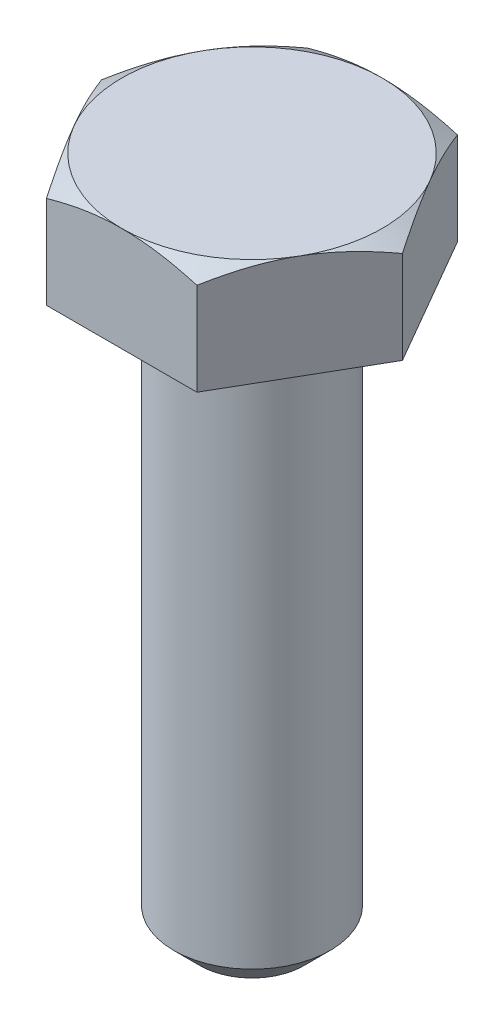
ISO-10303-21;
HEADER;
FILE_DESCRIPTION(('STEP AP214'),'2;1');
FILE_NAME('part.step','',(''),(''),'','','');
FILE_SCHEMA(('AUTOMOTIVE_DESIGN { 1 0 10303 214 1 1 1 1 }'));
ENDSEC;
DATA;
#1=APPLICATION_CONTEXT('core data for automotive mechanical design processes');
#2=APPLICATION_PROTOCOL_DEFINITION('international standard','automotive_design',2000,#1);
#3=PRODUCT_CONTEXT('',#1,'mechanical');
#4=PRODUCT('Part','Part','',(#3));
#5=PRODUCT_RELATED_PRODUCT_CATEGORY('part','',(#4));
#6=PRODUCT_DEFINITION_FORMATION('','',#4);
#7=PRODUCT_DEFINITION_CONTEXT('part definition',#1,'design');
#8=PRODUCT_DEFINITION('design','',#6,#7);
#9=PRODUCT_DEFINITION_SHAPE('','',#8);
#10=(LENGTH_UNIT() NAMED_UNIT(*) SI_UNIT(.MILLI.,.METRE.));
#11=(NAMED_UNIT(*) PLANE_ANGLE_UNIT() SI_UNIT($,.RADIAN.));
#12=(NAMED_UNIT(*) SI_UNIT($,.STERADIAN.) SOLID_ANGLE_UNIT());
#13=UNCERTAINTY_MEASURE_WITH_UNIT(LENGTH_MEASURE(1.E-05),#10,'distance_accuracy_value','');
#14=(GEOMETRIC_REPRESENTATION_CONTEXT(3) GLOBAL_UNCERTAINTY_ASSIGNED_CONTEXT((#13)) GLOBAL_UNIT_ASSIGNED_CONTEXT((#10,
#11,#12)) REPRESENTATION_CONTEXT('',''));
#15=CARTESIAN_POINT('',(0.,0.,0.));
#16=DIRECTION('',(0.,0.,1.));
#17=DIRECTION('',(1.,0.,0.));
#18=AXIS2_PLACEMENT_3D('',#15,#16,#17);
#19=CARTESIAN_POINT('',(0.,4.,0.));
#20=DIRECTION('',(0.,-1.,0.));
#21=DIRECTION('',(1.,0.,0.));
#22=AXIS2_PLACEMENT_3D('',#19,#20,#21);
#23=PLANE('',#22);
#24=CARTESIAN_POINT('',(0.,4.,0.));
#25=DIRECTION('',(0.,-1.,0.));
#26=DIRECTION('',(1.,0.,0.));
#27=AXIS2_PLACEMENT_3D('',#24,#25,#26);
#28=CIRCLE('',#27,5.);
#29=CARTESIAN_POINT('',(4.33012701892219,4.,2.50000000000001));
#30=VERTEX_POINT('',#29);
#31=CARTESIAN_POINT('',(0.,4.,4.99999999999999));
#32=VERTEX_POINT('',#31);
#33=EDGE_CURVE('E89',#30,#32,#28,.T.);
#34=ORIENTED_EDGE('',*,*,#33,.F.);
#35=CARTESIAN_POINT('',(0.,4.,0.));
#36=DIRECTION('',(0.,-1.,0.));
#37=DIRECTION('',(1.,0.,0.));
#38=AXIS2_PLACEMENT_3D('',#35,#36,#37);
#39=CIRCLE('',#38,5.);
#40=CARTESIAN_POINT('',(4.33012701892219,4.,-2.50000000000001));
#41=VERTEX_POINT('',#40);
#42=EDGE_CURVE('E87',#41,#30,#39,.T.);
#43=ORIENTED_EDGE('',*,*,#42,.F.);
#44=CARTESIAN_POINT('',(0.,4.,0.));
#45=DIRECTION('',(0.,-1.,0.));
#46=DIRECTION('',(1.,0.,0.));
#47=AXIS2_PLACEMENT_3D('',#44,#45,#46);
#48=CIRCLE('',#47,4.99999999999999);
#49=CARTESIAN_POINT('',(0.,4.,-4.99999999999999));
#50=VERTEX_POINT('',#49);
#51=EDGE_CURVE('E20',#50,#41,#48,.T.);
#52=ORIENTED_EDGE('',*,*,#51,.F.);
#53=CARTESIAN_POINT('',(0.,4.,0.));
#54=DIRECTION('',(0.,-1.,0.));
#55=DIRECTION('',(1.,0.,0.));
#56=AXIS2_PLACEMENT_3D('',#53,#54,#55);
#57=CIRCLE('',#56,5.);
#58=CARTESIAN_POINT('',(-4.33012701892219,4.,-2.50000000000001));
#59=VERTEX_POINT('',#58);
#60=EDGE_CURVE('E104',#59,#50,#57,.T.);
#61=ORIENTED_EDGE('',*,*,#60,.F.);
#62=CARTESIAN_POINT('',(0.,4.,0.));
#63=DIRECTION('',(0.,-1.,0.));
#64=DIRECTION('',(1.,0.,0.));
#65=AXIS2_PLACEMENT_3D('',#62,#63,#64);
#66=CIRCLE('',#65,5.);
#67=CARTESIAN_POINT('',(-4.33012701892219,4.,2.50000000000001));
#68=VERTEX_POINT('',#67);
#69=EDGE_CURVE('E323',#68,#59,#66,.T.);
#70=ORIENTED_EDGE('',*,*,#69,.F.);
#71=CARTESIAN_POINT('',(0.,4.,0.));
#72=DIRECTION('',(0.,-1.,0.));
#73=DIRECTION('',(1.,0.,0.));
#74=AXIS2_PLACEMENT_3D('',#71,#72,#73);
#75=CIRCLE('',#74,4.99999999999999);
#76=EDGE_CURVE('E93',#32,#68,#75,.T.);
#77=ORIENTED_EDGE('',*,*,#76,.F.);
#78=EDGE_LOOP('',(#34,#43,#52,#61,#70,#77));
#79=FACE_BOUND('',#78,.T.);
#80=ADVANCED_FACE('F16',(#79),#23,.F.);
#81=CARTESIAN_POINT('',(0.,3.55073852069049,0.));
#82=DIRECTION('',(0.,-1.,0.));
#83=DIRECTION('',(1.,0.,0.));
#84=AXIS2_PLACEMENT_3D('',#81,#82,#83);
#85=CONICAL_SURFACE('',#84,5.77814370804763,1.0471975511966);
#86=ORIENTED_EDGE('',*,*,#51,.T.);
#87=CARTESIAN_POINT('',(2.88675134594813,3.5534180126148,-4.99999999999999));
#88=CARTESIAN_POINT('',(3.00424151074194,3.62126800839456,-4.79650106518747));
#89=CARTESIAN_POINT('',(3.12267257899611,3.68343045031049,-4.59137243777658));
#90=CARTESIAN_POINT('',(3.36057867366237,3.79305279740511,-4.17930699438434));
#91=CARTESIAN_POINT('',(3.48004540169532,3.8405854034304,-3.97238455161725));
#92=CARTESIAN_POINT('',(3.66037296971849,3.89894737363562,-3.66004804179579));
#93=CARTESIAN_POINT('',(3.72070995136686,3.9162522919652,-3.55554132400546));
#94=CARTESIAN_POINT('',(3.84167277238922,3.94620746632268,-3.34602757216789));
#95=CARTESIAN_POINT('',(3.9022986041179,3.95885784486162,-3.24102055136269));
#96=CARTESIAN_POINT('',(4.02406337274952,3.97928167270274,-3.03011778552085));
#97=CARTESIAN_POINT('',(4.08520335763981,3.9870303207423,-2.92422022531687));
#98=CARTESIAN_POINT('',(4.20760356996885,3.99740020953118,-2.71221683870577));
#99=CARTESIAN_POINT('',(4.26886381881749,4.00002043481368,-2.60611097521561));
#100=CARTESIAN_POINT('',(4.33012701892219,4.,-2.50000000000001));
#101=B_SPLINE_CURVE_WITH_KNOTS('',3,(#87,#88,#89,#90,#91,#92,#93,#94,#95,#96,#97,#98,#99,#100),
.UNSPECIFIED.,.F.,.F.,(4,2,2,2,2,2,4),(0.,0.734036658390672,1.4643644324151,1.83000749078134,
2.19564092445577,2.56310985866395,2.93065154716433),.UNSPECIFIED.);
#102=CARTESIAN_POINT('',(2.88675134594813,3.5534180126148,-4.99999999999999));
#103=VERTEX_POINT('',#102);
#104=EDGE_CURVE('E99',#103,#41,#101,.T.);
#105=ORIENTED_EDGE('',*,*,#104,.F.);
#106=CARTESIAN_POINT('',(0.,4.00000000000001,-4.99999999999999));
#107=CARTESIAN_POINT('',(0.122526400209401,4.00002043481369,-4.99999999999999));
#108=CARTESIAN_POINT('',(0.245046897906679,3.99740020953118,-4.99999999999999));
#109=CARTESIAN_POINT('',(0.489847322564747,3.98703032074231,-4.99999999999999));
#110=CARTESIAN_POINT('',(0.61212729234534,3.97928167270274,-4.99999999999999));
#111=CARTESIAN_POINT('',(0.855656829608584,3.95885784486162,-4.99999999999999));
#112=CARTESIAN_POINT('',(0.976908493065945,3.94620746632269,-4.99999999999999));
#113=CARTESIAN_POINT('',(1.21883413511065,3.9162522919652,-4.99999999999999));
#114=CARTESIAN_POINT('',(1.33950809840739,3.89894737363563,-4.99999999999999));
#115=CARTESIAN_POINT('',(1.70016323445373,3.8405854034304,-4.99999999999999));
#116=CARTESIAN_POINT('',(1.93909669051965,3.79305279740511,-4.99999999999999));
#117=CARTESIAN_POINT('',(2.41490887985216,3.68343045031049,-4.99999999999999));
#118=CARTESIAN_POINT('',(2.6517710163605,3.62126800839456,-4.99999999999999));
#119=CARTESIAN_POINT('',(2.88675134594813,3.5534180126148,-4.99999999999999));
#120=B_SPLINE_CURVE_WITH_KNOTS('',3,(#106,#107,#108,#109,#110,#111,#112,#113,#114,#115,#116,
#117,#118,#119),.UNSPECIFIED.,.F.,.F.,(4,2,2,2,2,2,4),(0.,0.367541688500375,0.735010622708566,
1.10064405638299,1.46628711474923,2.19661488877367,2.93065154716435),.UNSPECIFIED.);
#121=EDGE_CURVE('E102',#50,#103,#120,.T.);
#122=ORIENTED_EDGE('',*,*,#121,.F.);
#123=EDGE_LOOP('',(#86,#105,#122));
#124=FACE_BOUND('',#123,.T.);
#125=ADVANCED_FACE('F97',(#124),#85,.T.);
#126=CARTESIAN_POINT('',(0.,3.55073852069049,0.));
#127=DIRECTION('',(0.,-1.,0.));
#128=DIRECTION('',(1.,0.,0.));
#129=AXIS2_PLACEMENT_3D('',#126,#127,#128);
#130=CONICAL_SURFACE('',#129,5.77814370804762,1.0471975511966);
#131=ORIENTED_EDGE('',*,*,#60,.T.);
#132=CARTESIAN_POINT('',(-2.88675134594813,3.5534180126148,-4.99999999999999));
#133=CARTESIAN_POINT('',(-2.65177101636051,3.62126800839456,-4.99999999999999));
#134=CARTESIAN_POINT('',(-2.41490887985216,3.68343045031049,-4.99999999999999));
#135=CARTESIAN_POINT('',(-1.93909669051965,3.79305279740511,-4.99999999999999));
#136=CARTESIAN_POINT('',(-1.70016323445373,3.8405854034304,-4.99999999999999));
#137=CARTESIAN_POINT('',(-1.33950809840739,3.89894737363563,-4.99999999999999));
#138=CARTESIAN_POINT('',(-1.21883413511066,3.9162522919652,-4.99999999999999));
#139=CARTESIAN_POINT('',(-0.976908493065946,3.94620746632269,-4.99999999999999));
#140=CARTESIAN_POINT('',(-0.855656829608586,3.95885784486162,-4.99999999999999));
#141=CARTESIAN_POINT('',(-0.612127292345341,3.97928167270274,-4.99999999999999));
#142=CARTESIAN_POINT('',(-0.489847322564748,3.98703032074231,-4.99999999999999));
#143=CARTESIAN_POINT('',(-0.245046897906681,3.99740020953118,-4.99999999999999));
#144=CARTESIAN_POINT('',(-0.122526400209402,4.00002043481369,-4.99999999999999));
#145=CARTESIAN_POINT('',(0.,4.00000000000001,-4.99999999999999));
#146=B_SPLINE_CURVE_WITH_KNOTS('',3,(#132,#133,#134,#135,#136,#137,#138,#139,#140,#141,#142,
#143,#144,#145),.UNSPECIFIED.,.F.,.F.,(4,2,2,2,2,2,4),(0.,0.734036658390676,1.46436443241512,
1.83000749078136,2.19564092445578,2.56310985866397,2.93065154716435),.UNSPECIFIED.);
#147=CARTESIAN_POINT('',(-2.88675134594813,3.5534180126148,-4.99999999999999));
#148=VERTEX_POINT('',#147);
#149=EDGE_CURVE('E113',#148,#50,#146,.T.);
#150=ORIENTED_EDGE('',*,*,#149,.F.);
#151=CARTESIAN_POINT('',(-4.33012701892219,4.,-2.50000000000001));
#152=CARTESIAN_POINT('',(-4.26886381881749,4.00002043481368,-2.60611097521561));
#153=CARTESIAN_POINT('',(-4.20760356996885,3.99740020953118,-2.71221683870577));
#154=CARTESIAN_POINT('',(-4.08520335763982,3.9870303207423,-2.92422022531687));
#155=CARTESIAN_POINT('',(-4.02406337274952,3.97928167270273,-3.03011778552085));
#156=CARTESIAN_POINT('',(-3.9022986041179,3.95885784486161,-3.24102055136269));
#157=CARTESIAN_POINT('',(-3.84167277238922,3.94620746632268,-3.34602757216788));
#158=CARTESIAN_POINT('',(-3.72070995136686,3.9162522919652,-3.55554132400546));
#159=CARTESIAN_POINT('',(-3.66037296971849,3.89894737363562,-3.66004804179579));
#160=CARTESIAN_POINT('',(-3.48004540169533,3.84058540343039,-3.97238455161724));
#161=CARTESIAN_POINT('',(-3.36057867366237,3.79305279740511,-4.17930699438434));
#162=CARTESIAN_POINT('',(-3.12267257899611,3.68343045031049,-4.59137243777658));
#163=CARTESIAN_POINT('',(-3.00424151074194,3.62126800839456,-4.79650106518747));
#164=CARTESIAN_POINT('',(-2.88675134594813,3.5534180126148,-4.99999999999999));
#165=B_SPLINE_CURVE_WITH_KNOTS('',3,(#151,#152,#153,#154,#155,#156,#157,#158,#159,#160,#161,
#162,#163,#164),.UNSPECIFIED.,.F.,.F.,(4,2,2,2,2,2,4),(0.,0.367541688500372,0.735010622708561,
1.10064405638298,1.46628711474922,2.19661488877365,2.93065154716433),.UNSPECIFIED.);
#166=EDGE_CURVE('E169',#59,#148,#165,.T.);
#167=ORIENTED_EDGE('',*,*,#166,.F.);
#168=EDGE_LOOP('',(#131,#150,#167));
#169=FACE_BOUND('',#168,.T.);
#170=ADVANCED_FACE('F137',(#169),#130,.T.);
#171=CARTESIAN_POINT('',(0.,3.55073852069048,0.));
#172=DIRECTION('',(0.,-1.,0.));
#173=DIRECTION('',(1.,0.,0.));
#174=AXIS2_PLACEMENT_3D('',#171,#172,#173);
#175=CONICAL_SURFACE('',#174,5.77814370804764,1.0471975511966);
#176=ORIENTED_EDGE('',*,*,#69,.T.);
#177=CARTESIAN_POINT('',(-5.77350269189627,3.55341801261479,0.));
#178=CARTESIAN_POINT('',(-5.65601252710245,3.62126800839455,-0.203498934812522));
#179=CARTESIAN_POINT('',(-5.53758145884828,3.68343045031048,-0.40862756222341));
#180=CARTESIAN_POINT('',(-5.29967536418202,3.7930527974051,-0.820693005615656));
#181=CARTESIAN_POINT('',(-5.18020863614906,3.84058540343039,-1.02761544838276));
#182=CARTESIAN_POINT('',(-4.99988106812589,3.89894737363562,-1.33995195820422));
#183=CARTESIAN_POINT('',(-4.93954408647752,3.91625229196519,-1.44445867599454));
#184=CARTESIAN_POINT('',(-4.81858126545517,3.94620746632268,-1.65397242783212));
#185=CARTESIAN_POINT('',(-4.75795543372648,3.95885784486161,-1.75897944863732));
#186=CARTESIAN_POINT('',(-4.63619066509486,3.97928167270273,-1.96988221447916));
#187=CARTESIAN_POINT('',(-4.57505068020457,3.9870303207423,-2.07577977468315));
#188=CARTESIAN_POINT('',(-4.45265046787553,3.99740020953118,-2.28778316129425));
#189=CARTESIAN_POINT('',(-4.39139021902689,4.00002043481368,-2.39388902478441));
#190=CARTESIAN_POINT('',(-4.33012701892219,4.,-2.50000000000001));
#191=B_SPLINE_CURVE_WITH_KNOTS('',3,(#177,#178,#179,#180,#181,#182,#183,#184,#185,#186,#187,
#188,#189,#190),.UNSPECIFIED.,.F.,.F.,(4,2,2,2,2,2,4),(0.,0.73403665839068,1.46436443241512,
1.83000749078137,2.19564092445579,2.56310985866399,2.93065154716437),.UNSPECIFIED.);
#192=CARTESIAN_POINT('',(-5.77350269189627,3.55341801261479,0.));
#193=VERTEX_POINT('',#192);
#194=EDGE_CURVE('E146',#193,#59,#191,.T.);
#195=ORIENTED_EDGE('',*,*,#194,.F.);
#196=CARTESIAN_POINT('',(-4.33012701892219,4.,2.50000000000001));
#197=CARTESIAN_POINT('',(-4.39139021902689,4.00002043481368,2.39388902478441));
#198=CARTESIAN_POINT('',(-4.45265046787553,3.99740020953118,2.28778316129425));
#199=CARTESIAN_POINT('',(-4.57505068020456,3.9870303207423,2.07577977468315));
#200=CARTESIAN_POINT('',(-4.63619066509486,3.97928167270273,1.96988221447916));
#201=CARTESIAN_POINT('',(-4.75795543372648,3.95885784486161,1.75897944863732));
#202=CARTESIAN_POINT('',(-4.81858126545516,3.94620746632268,1.65397242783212));
#203=CARTESIAN_POINT('',(-4.93954408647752,3.9162522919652,1.44445867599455));
#204=CARTESIAN_POINT('',(-4.99988106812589,3.89894737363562,1.33995195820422));
#205=CARTESIAN_POINT('',(-5.18020863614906,3.84058540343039,1.02761544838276));
#206=CARTESIAN_POINT('',(-5.29967536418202,3.7930527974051,0.820693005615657));
#207=CARTESIAN_POINT('',(-5.53758145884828,3.68343045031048,0.408627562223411));
#208=CARTESIAN_POINT('',(-5.65601252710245,3.62126800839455,0.203498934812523));
#209=CARTESIAN_POINT('',(-5.77350269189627,3.55341801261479,0.));
#210=B_SPLINE_CURVE_WITH_KNOTS('',3,(#196,#197,#198,#199,#200,#201,#202,#203,#204,#205,#206,
#207,#208,#209),.UNSPECIFIED.,.F.,.F.,(4,2,2,2,2,2,4),(0.,0.367541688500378,0.735010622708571,
1.100644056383,1.46628711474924,2.19661488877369,2.93065154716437),.UNSPECIFIED.);
#211=EDGE_CURVE('E183',#68,#193,#210,.T.);
#212=ORIENTED_EDGE('',*,*,#211,.F.);
#213=EDGE_LOOP('',(#176,#195,#212));
#214=FACE_BOUND('',#213,.T.);
#215=ADVANCED_FACE('F191',(#214),#175,.T.);
#216=CARTESIAN_POINT('',(0.,3.55073852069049,0.));
#217=DIRECTION('',(0.,-1.,0.));
#218=DIRECTION('',(1.,0.,0.));
#219=AXIS2_PLACEMENT_3D('',#216,#217,#218);
#220=CONICAL_SURFACE('',#219,5.77814370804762,1.0471975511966);
#221=ORIENTED_EDGE('',*,*,#76,.T.);
#222=CARTESIAN_POINT('',(-2.88675134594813,3.5534180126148,4.99999999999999));
#223=CARTESIAN_POINT('',(-3.00424151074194,3.62126800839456,4.79650106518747));
#224=CARTESIAN_POINT('',(-3.12267257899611,3.68343045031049,4.59137243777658));
#225=CARTESIAN_POINT('',(-3.36057867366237,3.7930527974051,4.17930699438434));
#226=CARTESIAN_POINT('',(-3.48004540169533,3.84058540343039,3.97238455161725));
#227=CARTESIAN_POINT('',(-3.66037296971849,3.89894737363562,3.66004804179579));
#228=CARTESIAN_POINT('',(-3.72070995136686,3.9162522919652,3.55554132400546));
#229=CARTESIAN_POINT('',(-3.84167277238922,3.94620746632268,3.34602757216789));
#230=CARTESIAN_POINT('',(-3.9022986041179,3.95885784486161,3.24102055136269));
#231=CARTESIAN_POINT('',(-4.02406337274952,3.97928167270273,3.03011778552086));
#232=CARTESIAN_POINT('',(-4.08520335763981,3.9870303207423,2.92422022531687));
#233=CARTESIAN_POINT('',(-4.20760356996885,3.99740020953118,2.71221683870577));
#234=CARTESIAN_POINT('',(-4.26886381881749,4.00002043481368,2.60611097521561));
#235=CARTESIAN_POINT('',(-4.33012701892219,4.,2.50000000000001));
#236=B_SPLINE_CURVE_WITH_KNOTS('',3,(#222,#223,#224,#225,#226,#227,#228,#229,#230,#231,#232,
#233,#234,#235),.UNSPECIFIED.,.F.,.F.,(4,2,2,2,2,2,4),(0.,0.734036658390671,1.4643644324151,
1.83000749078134,2.19564092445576,2.56310985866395,2.93065154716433),.UNSPECIFIED.);
#237=CARTESIAN_POINT('',(-2.88675134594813,3.5534180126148,4.99999999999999));
#238=VERTEX_POINT('',#237);
#239=EDGE_CURVE('E176',#238,#68,#236,.T.);
#240=ORIENTED_EDGE('',*,*,#239,.F.);
#241=CARTESIAN_POINT('',(0.,4.00000000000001,4.99999999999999));
#242=CARTESIAN_POINT('',(-0.122526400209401,4.00002043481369,4.99999999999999));
#243=CARTESIAN_POINT('',(-0.24504689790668,3.99740020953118,4.99999999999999));
#244=CARTESIAN_POINT('',(-0.489847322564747,3.98703032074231,4.99999999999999));
#245=CARTESIAN_POINT('',(-0.61212729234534,3.97928167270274,4.99999999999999));
#246=CARTESIAN_POINT('',(-0.855656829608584,3.95885784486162,4.99999999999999));
#247=CARTESIAN_POINT('',(-0.976908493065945,3.94620746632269,4.99999999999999));
#248=CARTESIAN_POINT('',(-1.21883413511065,3.9162522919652,4.99999999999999));
#249=CARTESIAN_POINT('',(-1.33950809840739,3.89894737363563,4.99999999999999));
#250=CARTESIAN_POINT('',(-1.70016323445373,3.8405854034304,4.99999999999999));
#251=CARTESIAN_POINT('',(-1.93909669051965,3.79305279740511,4.99999999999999));
#252=CARTESIAN_POINT('',(-2.41490887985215,3.68343045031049,4.99999999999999));
#253=CARTESIAN_POINT('',(-2.6517710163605,3.62126800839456,4.99999999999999));
#254=CARTESIAN_POINT('',(-2.88675134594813,3.5534180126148,4.99999999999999));
#255=B_SPLINE_CURVE_WITH_KNOTS('',3,(#241,#242,#243,#244,#245,#246,#247,#248,#249,#250,#251,
#252,#253,#254),.UNSPECIFIED.,.F.,.F.,(4,2,2,2,2,2,4),(0.,0.367541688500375,0.735010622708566,
1.10064405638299,1.46628711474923,2.19661488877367,2.93065154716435),.UNSPECIFIED.);
#256=EDGE_CURVE('E198',#32,#238,#255,.T.);
#257=ORIENTED_EDGE('',*,*,#256,.F.);
#258=EDGE_LOOP('',(#221,#240,#257));
#259=FACE_BOUND('',#258,.T.);
#260=ADVANCED_FACE('F188',(#259),#220,.T.);
#261=CARTESIAN_POINT('',(0.,3.55073852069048,0.));
#262=DIRECTION('',(0.,-1.,0.));
#263=DIRECTION('',(1.,0.,0.));
#264=AXIS2_PLACEMENT_3D('',#261,#262,#263);
#265=CONICAL_SURFACE('',#264,5.77814370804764,1.0471975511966);
#266=ORIENTED_EDGE('',*,*,#42,.T.);
#267=CARTESIAN_POINT('',(5.77350269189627,3.55341801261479,0.));
#268=CARTESIAN_POINT('',(5.65601252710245,3.62126800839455,0.203498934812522));
#269=CARTESIAN_POINT('',(5.53758145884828,3.68343045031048,0.40862756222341));
#270=CARTESIAN_POINT('',(5.29967536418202,3.7930527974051,0.820693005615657));
#271=CARTESIAN_POINT('',(5.18020863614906,3.84058540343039,1.02761544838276));
#272=CARTESIAN_POINT('',(4.99988106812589,3.89894737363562,1.33995195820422));
#273=CARTESIAN_POINT('',(4.93954408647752,3.9162522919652,1.44445867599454));
#274=CARTESIAN_POINT('',(4.81858126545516,3.94620746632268,1.65397242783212));
#275=CARTESIAN_POINT('',(4.75795543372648,3.95885784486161,1.75897944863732));
#276=CARTESIAN_POINT('',(4.63619066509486,3.97928167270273,1.96988221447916));
#277=CARTESIAN_POINT('',(4.57505068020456,3.9870303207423,2.07577977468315));
#278=CARTESIAN_POINT('',(4.45265046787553,3.99740020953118,2.28778316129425));
#279=CARTESIAN_POINT('',(4.39139021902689,4.00002043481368,2.39388902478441));
#280=CARTESIAN_POINT('',(4.33012701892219,4.,2.50000000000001));
#281=B_SPLINE_CURVE_WITH_KNOTS('',3,(#267,#268,#269,#270,#271,#272,#273,#274,#275,#276,#277,
#278,#279,#280),.UNSPECIFIED.,.F.,.F.,(4,2,2,2,2,2,4),(0.,0.734036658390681,1.46436443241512,
1.83000749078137,2.19564092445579,2.56310985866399,2.93065154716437),.UNSPECIFIED.);
#282=CARTESIAN_POINT('',(5.77350269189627,3.55341801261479,0.));
#283=VERTEX_POINT('',#282);
#284=EDGE_CURVE('E109',#283,#30,#281,.T.);
#285=ORIENTED_EDGE('',*,*,#284,.F.);
#286=CARTESIAN_POINT('',(4.33012701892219,4.,-2.50000000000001));
#287=CARTESIAN_POINT('',(4.39139021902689,4.00002043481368,-2.39388902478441));
#288=CARTESIAN_POINT('',(4.45265046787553,3.99740020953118,-2.28778316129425));
#289=CARTESIAN_POINT('',(4.57505068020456,3.9870303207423,-2.07577977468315));
#290=CARTESIAN_POINT('',(4.63619066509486,3.97928167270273,-1.96988221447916));
#291=CARTESIAN_POINT('',(4.75795543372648,3.95885784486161,-1.75897944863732));
#292=CARTESIAN_POINT('',(4.81858126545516,3.94620746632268,-1.65397242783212));
#293=CARTESIAN_POINT('',(4.93954408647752,3.9162522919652,-1.44445867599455));
#294=CARTESIAN_POINT('',(4.99988106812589,3.89894737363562,-1.33995195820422));
#295=CARTESIAN_POINT('',(5.18020863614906,3.84058540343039,-1.02761544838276));
#296=CARTESIAN_POINT('',(5.29967536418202,3.7930527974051,-0.820693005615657));
#297=CARTESIAN_POINT('',(5.53758145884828,3.68343045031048,-0.408627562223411));
#298=CARTESIAN_POINT('',(5.65601252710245,3.62126800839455,-0.203498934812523));
#299=CARTESIAN_POINT('',(5.77350269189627,3.55341801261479,0.));
#300=B_SPLINE_CURVE_WITH_KNOTS('',3,(#286,#287,#288,#289,#290,#291,#292,#293,#294,#295,#296,
#297,#298,#299),.UNSPECIFIED.,.F.,.F.,(4,2,2,2,2,2,4),(0.,0.367541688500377,0.735010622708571,
1.100644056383,1.46628711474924,2.19661488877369,2.93065154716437),.UNSPECIFIED.);
#301=EDGE_CURVE('E106',#41,#283,#300,.T.);
#302=ORIENTED_EDGE('',*,*,#301,.F.);
#303=EDGE_LOOP('',(#266,#285,#302));
#304=FACE_BOUND('',#303,.T.);
#305=ADVANCED_FACE('F107',(#304),#265,.T.);
#306=CARTESIAN_POINT('',(0.,3.55073852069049,0.));
#307=DIRECTION('',(0.,-1.,0.));
#308=DIRECTION('',(1.,0.,0.));
#309=AXIS2_PLACEMENT_3D('',#306,#307,#308);
#310=CONICAL_SURFACE('',#309,5.77814370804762,1.0471975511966);
#311=ORIENTED_EDGE('',*,*,#33,.T.);
#312=CARTESIAN_POINT('',(2.88675134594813,3.5534180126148,4.99999999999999));
#313=CARTESIAN_POINT('',(2.6517710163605,3.62126800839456,4.99999999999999));
#314=CARTESIAN_POINT('',(2.41490887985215,3.68343045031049,4.99999999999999));
#315=CARTESIAN_POINT('',(1.93909669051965,3.79305279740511,4.99999999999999));
#316=CARTESIAN_POINT('',(1.70016323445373,3.8405854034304,4.99999999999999));
#317=CARTESIAN_POINT('',(1.33950809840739,3.89894737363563,4.99999999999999));
#318=CARTESIAN_POINT('',(1.21883413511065,3.9162522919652,4.99999999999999));
#319=CARTESIAN_POINT('',(0.976908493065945,3.94620746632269,4.99999999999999));
#320=CARTESIAN_POINT('',(0.855656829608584,3.95885784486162,4.99999999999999));
#321=CARTESIAN_POINT('',(0.61212729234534,3.97928167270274,4.99999999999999));
#322=CARTESIAN_POINT('',(0.489847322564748,3.98703032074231,4.99999999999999));
#323=CARTESIAN_POINT('',(0.24504689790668,3.99740020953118,4.99999999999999));
#324=CARTESIAN_POINT('',(0.122526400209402,4.00002043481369,4.99999999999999));
#325=CARTESIAN_POINT('',(0.,4.00000000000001,4.99999999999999));
#326=B_SPLINE_CURVE_WITH_KNOTS('',3,(#312,#313,#314,#315,#316,#317,#318,#319,#320,#321,#322,
#323,#324,#325),.UNSPECIFIED.,.F.,.F.,(4,2,2,2,2,2,4),(0.,0.734036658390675,1.46436443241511,
1.83000749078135,2.19564092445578,2.56310985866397,2.93065154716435),.UNSPECIFIED.);
#327=CARTESIAN_POINT('',(2.88675134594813,3.5534180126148,4.99999999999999));
#328=VERTEX_POINT('',#327);
#329=EDGE_CURVE('E205',#328,#32,#326,.T.);
#330=ORIENTED_EDGE('',*,*,#329,.F.);
#331=CARTESIAN_POINT('',(4.33012701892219,4.,2.50000000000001));
#332=CARTESIAN_POINT('',(4.26886381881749,4.00002043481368,2.60611097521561));
#333=CARTESIAN_POINT('',(4.20760356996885,3.99740020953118,2.71221683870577));
#334=CARTESIAN_POINT('',(4.08520335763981,3.9870303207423,2.92422022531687));
#335=CARTESIAN_POINT('',(4.02406337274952,3.97928167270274,3.03011778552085));
#336=CARTESIAN_POINT('',(3.90229860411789,3.95885784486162,3.24102055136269));
#337=CARTESIAN_POINT('',(3.84167277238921,3.94620746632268,3.34602757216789));
#338=CARTESIAN_POINT('',(3.72070995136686,3.9162522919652,3.55554132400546));
#339=CARTESIAN_POINT('',(3.66037296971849,3.89894737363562,3.66004804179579));
#340=CARTESIAN_POINT('',(3.48004540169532,3.8405854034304,3.97238455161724));
#341=CARTESIAN_POINT('',(3.36057867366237,3.79305279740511,4.17930699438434));
#342=CARTESIAN_POINT('',(3.12267257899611,3.68343045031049,4.59137243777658));
#343=CARTESIAN_POINT('',(3.00424151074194,3.62126800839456,4.79650106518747));
#344=CARTESIAN_POINT('',(2.88675134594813,3.5534180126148,4.99999999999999));
#345=B_SPLINE_CURVE_WITH_KNOTS('',3,(#331,#332,#333,#334,#335,#336,#337,#338,#339,#340,#341,
#342,#343,#344),.UNSPECIFIED.,.F.,.F.,(4,2,2,2,2,2,4),(0.,0.367541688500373,0.735010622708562,
1.10064405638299,1.46628711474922,2.19661488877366,2.93065154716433),.UNSPECIFIED.);
#346=EDGE_CURVE('E225',#30,#328,#345,.T.);
#347=ORIENTED_EDGE('',*,*,#346,.F.);
#348=EDGE_LOOP('',(#311,#330,#347));
#349=FACE_BOUND('',#348,.T.);
#350=ADVANCED_FACE('F233',(#349),#310,.T.);
#351=CARTESIAN_POINT('',(0.,-22.,0.));
#352=DIRECTION('',(0.,1.,0.));
#353=DIRECTION('',(0.,0.,1.));
#354=AXIS2_PLACEMENT_3D('',#351,#352,#353);
#355=PLANE('',#354);
#356=CARTESIAN_POINT('',(0.,-21.9999999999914,0.));
#357=DIRECTION('',(0.,1.,0.));
#358=DIRECTION('',(0.,0.,1.));
#359=AXIS2_PLACEMENT_3D('',#356,#357,#358);
#360=CIRCLE('',#359,1.99999999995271);
#361=CARTESIAN_POINT('',(0.,-21.9999999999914,1.99999999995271));
#362=VERTEX_POINT('',#361);
#363=EDGE_CURVE('E232',#362,#362,#360,.T.);
#364=ORIENTED_EDGE('',*,*,#363,.F.);
#365=EDGE_LOOP('',(#364));
#366=FACE_BOUND('',#365,.T.);
#367=ADVANCED_FACE('F236',(#366),#355,.F.);
#368=CARTESIAN_POINT('',(2.88675134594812,24.2,-4.99999999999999));
#369=DIRECTION('',(0.866025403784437,0.,-0.500000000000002));
#370=DIRECTION('',(-0.500000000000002,0.,-0.866025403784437));
#371=AXIS2_PLACEMENT_3D('',#368,#369,#370);
#372=PLANE('',#371);
#373=DIRECTION('',(-0.500000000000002,0.,-0.866025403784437));
#374=VECTOR('',#373,1.);
#375=CARTESIAN_POINT('',(5.77350269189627,0.,0.));
#376=LINE('',#375,#374);
#377=CARTESIAN_POINT('',(5.77350269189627,0.,0.));
#378=VERTEX_POINT('',#377);
#379=CARTESIAN_POINT('',(2.88675134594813,0.,-4.99999999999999));
#380=VERTEX_POINT('',#379);
#381=EDGE_CURVE('E268',#378,#380,#376,.T.);
#382=ORIENTED_EDGE('',*,*,#381,.T.);
#383=DIRECTION('',(0.,1.,0.));
#384=VECTOR('',#383,1.);
#385=CARTESIAN_POINT('',(2.88675134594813,24.2,-4.99999999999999));
#386=LINE('',#385,#384);
#387=EDGE_CURVE('E117',#103,#380,#386,.F.);
#388=ORIENTED_EDGE('',*,*,#387,.F.);
#389=ORIENTED_EDGE('',*,*,#104,.T.);
#390=ORIENTED_EDGE('',*,*,#301,.T.);
#391=DIRECTION('',(0.,1.,0.));
#392=VECTOR('',#391,1.);
#393=CARTESIAN_POINT('',(5.77350269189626,24.2,0.));
#394=LINE('',#393,#392);
#395=EDGE_CURVE('E312',#378,#283,#394,.T.);
#396=ORIENTED_EDGE('',*,*,#395,.F.);
#397=EDGE_LOOP('',(#382,#388,#389,#390,#396));
#398=FACE_BOUND('',#397,.T.);
#399=ADVANCED_FACE('F115',(#398),#372,.T.);
#400=CARTESIAN_POINT('',(-2.88675134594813,24.2,-4.99999999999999));
#401=DIRECTION('',(0.,0.,-1.));
#402=DIRECTION('',(-1.,0.,0.));
#403=AXIS2_PLACEMENT_3D('',#400,#401,#402);
#404=PLANE('',#403);
#405=DIRECTION('',(-1.,0.,0.));
#406=VECTOR('',#405,1.);
#407=CARTESIAN_POINT('',(0.,0.,-4.99999999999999));
#408=LINE('',#407,#406);
#409=CARTESIAN_POINT('',(-2.88675134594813,0.,-4.99999999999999));
#410=VERTEX_POINT('',#409);
#411=EDGE_CURVE('E270',#380,#410,#408,.T.);
#412=ORIENTED_EDGE('',*,*,#411,.T.);
#413=DIRECTION('',(0.,1.,0.));
#414=VECTOR('',#413,1.);
#415=CARTESIAN_POINT('',(-2.88675134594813,24.2,-4.99999999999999));
#416=LINE('',#415,#414);
#417=EDGE_CURVE('E175',#148,#410,#416,.F.);
#418=ORIENTED_EDGE('',*,*,#417,.F.);
#419=ORIENTED_EDGE('',*,*,#149,.T.);
#420=ORIENTED_EDGE('',*,*,#121,.T.);
#421=ORIENTED_EDGE('',*,*,#387,.T.);
#422=EDGE_LOOP('',(#412,#418,#419,#420,#421));
#423=FACE_BOUND('',#422,.T.);
#424=ADVANCED_FACE('F155',(#423),#404,.T.);
#425=CARTESIAN_POINT('',(-2.88675134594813,24.2,-4.99999999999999));
#426=DIRECTION('',(-0.866025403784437,0.,-0.500000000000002));
#427=DIRECTION('',(-0.500000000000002,0.,0.866025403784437));
#428=AXIS2_PLACEMENT_3D('',#425,#426,#427);
#429=PLANE('',#428);
#430=DIRECTION('',(-0.500000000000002,0.,0.866025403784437));
#431=VECTOR('',#430,1.);
#432=CARTESIAN_POINT('',(-2.88675134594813,0.,-4.99999999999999));
#433=LINE('',#432,#431);
#434=CARTESIAN_POINT('',(-5.77350269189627,0.,0.));
#435=VERTEX_POINT('',#434);
#436=EDGE_CURVE('E278',#410,#435,#433,.T.);
#437=ORIENTED_EDGE('',*,*,#436,.T.);
#438=DIRECTION('',(0.,1.,0.));
#439=VECTOR('',#438,1.);
#440=CARTESIAN_POINT('',(-5.77350269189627,24.2,0.));
#441=LINE('',#440,#439);
#442=EDGE_CURVE('E302',#193,#435,#441,.F.);
#443=ORIENTED_EDGE('',*,*,#442,.F.);
#444=ORIENTED_EDGE('',*,*,#194,.T.);
#445=ORIENTED_EDGE('',*,*,#166,.T.);
#446=ORIENTED_EDGE('',*,*,#417,.T.);
#447=EDGE_LOOP('',(#437,#443,#444,#445,#446));
#448=FACE_BOUND('',#447,.T.);
#449=ADVANCED_FACE('F158',(#448),#429,.T.);
#450=CARTESIAN_POINT('',(-2.88675134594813,24.2,4.99999999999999));
#451=DIRECTION('',(-0.866025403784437,0.,0.500000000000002));
#452=DIRECTION('',(0.500000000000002,0.,0.866025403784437));
#453=AXIS2_PLACEMENT_3D('',#450,#451,#452);
#454=PLANE('',#453);
#455=DIRECTION('',(0.500000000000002,0.,0.866025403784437));
#456=VECTOR('',#455,1.);
#457=CARTESIAN_POINT('',(-5.77350269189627,0.,0.));
#458=LINE('',#457,#456);
#459=CARTESIAN_POINT('',(-2.88675134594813,0.,4.99999999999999));
#460=VERTEX_POINT('',#459);
#461=EDGE_CURVE('E274',#435,#460,#458,.T.);
#462=ORIENTED_EDGE('',*,*,#461,.T.);
#463=DIRECTION('',(0.,1.,0.));
#464=VECTOR('',#463,1.);
#465=CARTESIAN_POINT('',(-2.88675134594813,24.2,4.99999999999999));
#466=LINE('',#465,#464);
#467=EDGE_CURVE('E204',#238,#460,#466,.F.);
#468=ORIENTED_EDGE('',*,*,#467,.F.);
#469=ORIENTED_EDGE('',*,*,#239,.T.);
#470=ORIENTED_EDGE('',*,*,#211,.T.);
#471=ORIENTED_EDGE('',*,*,#442,.T.);
#472=EDGE_LOOP('',(#462,#468,#469,#470,#471));
#473=FACE_BOUND('',#472,.T.);
#474=ADVANCED_FACE('F164',(#473),#454,.T.);
#475=CARTESIAN_POINT('',(-2.88675134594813,24.2,4.99999999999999));
#476=DIRECTION('',(0.,0.,1.));
#477=DIRECTION('',(1.,0.,0.));
#478=AXIS2_PLACEMENT_3D('',#475,#476,#477);
#479=PLANE('',#478);
#480=DIRECTION('',(-1.,0.,0.));
#481=VECTOR('',#480,1.);
#482=CARTESIAN_POINT('',(0.,0.,4.99999999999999));
#483=LINE('',#482,#481);
#484=CARTESIAN_POINT('',(2.88675134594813,0.,4.99999999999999));
#485=VERTEX_POINT('',#484);
#486=EDGE_CURVE('E35',#460,#485,#483,.F.);
#487=ORIENTED_EDGE('',*,*,#486,.T.);
#488=DIRECTION('',(0.,1.,0.));
#489=VECTOR('',#488,1.);
#490=CARTESIAN_POINT('',(2.88675134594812,24.2,4.99999999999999));
#491=LINE('',#490,#489);
#492=EDGE_CURVE('E231',#328,#485,#491,.F.);
#493=ORIENTED_EDGE('',*,*,#492,.F.);
#494=ORIENTED_EDGE('',*,*,#329,.T.);
#495=ORIENTED_EDGE('',*,*,#256,.T.);
#496=ORIENTED_EDGE('',*,*,#467,.T.);
#497=EDGE_LOOP('',(#487,#493,#494,#495,#496));
#498=FACE_BOUND('',#497,.T.);
#499=ADVANCED_FACE('F214',(#498),#479,.T.);
#500=CARTESIAN_POINT('',(2.88675134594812,24.2,4.99999999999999));
#501=DIRECTION('',(0.866025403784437,0.,0.500000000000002));
#502=DIRECTION('',(0.500000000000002,0.,-0.866025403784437));
#503=AXIS2_PLACEMENT_3D('',#500,#501,#502);
#504=PLANE('',#503);
#505=DIRECTION('',(0.500000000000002,0.,-0.866025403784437));
#506=VECTOR('',#505,1.);
#507=CARTESIAN_POINT('',(2.88675134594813,0.,4.99999999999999));
#508=LINE('',#507,#506);
#509=EDGE_CURVE('E258',#485,#378,#508,.T.);
#510=ORIENTED_EDGE('',*,*,#509,.T.);
#511=ORIENTED_EDGE('',*,*,#395,.T.);
#512=ORIENTED_EDGE('',*,*,#284,.T.);
#513=ORIENTED_EDGE('',*,*,#346,.T.);
#514=ORIENTED_EDGE('',*,*,#492,.T.);
#515=EDGE_LOOP('',(#510,#511,#512,#513,#514));
#516=FACE_BOUND('',#515,.T.);
#517=ADVANCED_FACE('F217',(#516),#504,.T.);
#518=CARTESIAN_POINT('',(0.,-21.000000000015,0.));
#519=DIRECTION('',(0.,1.,0.));
#520=DIRECTION('',(0.,0.,1.));
#521=AXIS2_PLACEMENT_3D('',#518,#519,#520);
#522=CONICAL_SURFACE('',#521,2.99999999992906,0.785398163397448);
#523=CARTESIAN_POINT('',(0.,-21.,0.));
#524=DIRECTION('',(0.,1.,0.));
#525=DIRECTION('',(0.,0.,1.));
#526=AXIS2_PLACEMENT_3D('',#523,#524,#525);
#527=CIRCLE('',#526,3.);
#528=CARTESIAN_POINT('',(0.,-21.,3.));
#529=VERTEX_POINT('',#528);
#530=EDGE_CURVE('E26',#529,#529,#527,.T.);
#531=ORIENTED_EDGE('',*,*,#530,.F.);
#532=EDGE_LOOP('',(#531));
#533=FACE_BOUND('',#532,.T.);
#534=ORIENTED_EDGE('',*,*,#363,.T.);
#535=EDGE_LOOP('',(#534));
#536=FACE_BOUND('',#535,.T.);
#537=ADVANCED_FACE('F222',(#533,#536),#522,.T.);
#538=CARTESIAN_POINT('',(0.,0.,0.));
#539=DIRECTION('',(0.,1.,0.));
#540=DIRECTION('',(-1.,0.,0.));
#541=AXIS2_PLACEMENT_3D('',#538,#539,#540);
#542=PLANE('',#541);
#543=ORIENTED_EDGE('',*,*,#486,.F.);
#544=ORIENTED_EDGE('',*,*,#461,.F.);
#545=ORIENTED_EDGE('',*,*,#436,.F.);
#546=ORIENTED_EDGE('',*,*,#411,.F.);
#547=ORIENTED_EDGE('',*,*,#381,.F.);
#548=ORIENTED_EDGE('',*,*,#509,.F.);
#549=EDGE_LOOP('',(#543,#544,#545,#546,#547,#548));
#550=FACE_BOUND('',#549,.T.);
#551=CARTESIAN_POINT('',(0.,0.,0.));
#552=DIRECTION('',(0.,1.,0.));
#553=DIRECTION('',(0.,0.,1.));
#554=AXIS2_PLACEMENT_3D('',#551,#552,#553);
#555=CIRCLE('',#554,3.);
#556=CARTESIAN_POINT('',(0.,0.,3.));
#557=VERTEX_POINT('',#556);
#558=EDGE_CURVE('E10',#557,#557,#555,.F.);
#559=ORIENTED_EDGE('',*,*,#558,.F.);
#560=EDGE_LOOP('',(#559));
#561=FACE_BOUND('',#560,.T.);
#562=ADVANCED_FACE('F247',(#550,#561),#542,.F.);
#563=CARTESIAN_POINT('',(0.,-22.,0.));
#564=DIRECTION('',(0.,1.,0.));
#565=DIRECTION('',(0.,0.,1.));
#566=AXIS2_PLACEMENT_3D('',#563,#564,#565);
#567=CYLINDRICAL_SURFACE('',#566,3.);
#568=ORIENTED_EDGE('',*,*,#558,.T.);
#569=EDGE_LOOP('',(#568));
#570=FACE_BOUND('',#569,.T.);
#571=ORIENTED_EDGE('',*,*,#530,.T.);
#572=EDGE_LOOP('',(#571));
#573=FACE_BOUND('',#572,.T.);
#574=ADVANCED_FACE('F18',(#570,#573),#567,.T.);
#575=CLOSED_SHELL('',(#80,#125,#170,#215,#260,#305,#350,#367,#399,#424,#449,#474,#499,#517,#537,
#562,#574));
#576=MANIFOLD_SOLID_BREP('B1',#575);
#577=ADVANCED_BREP_SHAPE_REPRESENTATION('',(#18,#576),#14);
#578=SHAPE_DEFINITION_REPRESENTATION(#9,#577);
ENDSEC;
END-ISO-10303-21;
